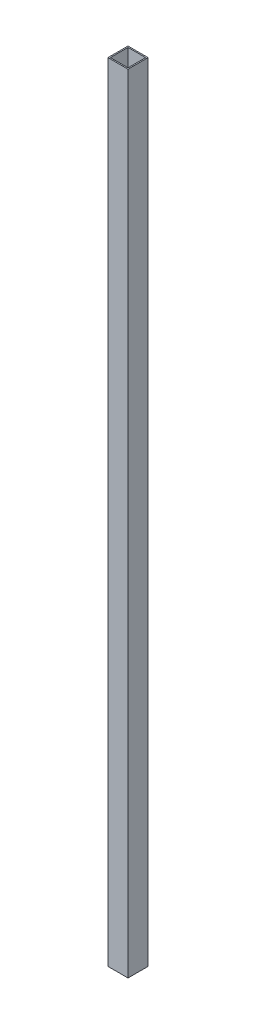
from build123d import *

# Parameters (mm, degrees)
ESQUISSE1_W      = 50
ESQUISSE1_H      = 50
ESQUISSE1_W_2    = 44
ESQUISSE1_H_2    = 44
EXTRUSION1_DEPTH = 1960


with BuildPart() as part:
    # Esquisse1 → Extrusion1 (new body)
    with BuildSketch(Plane(origin=(0, 0, 0), x_dir=(1, 0, 0), z_dir=(0, 1, 0))):
        with Locations((25, 25)):
            Rectangle(ESQUISSE1_W, ESQUISSE1_H)
        with Locations((25, 25)):
            Rectangle(ESQUISSE1_W_2, ESQUISSE1_H_2, mode=Mode.SUBTRACT)
    extrude(amount=EXTRUSION1_DEPTH)


solid = part.part
